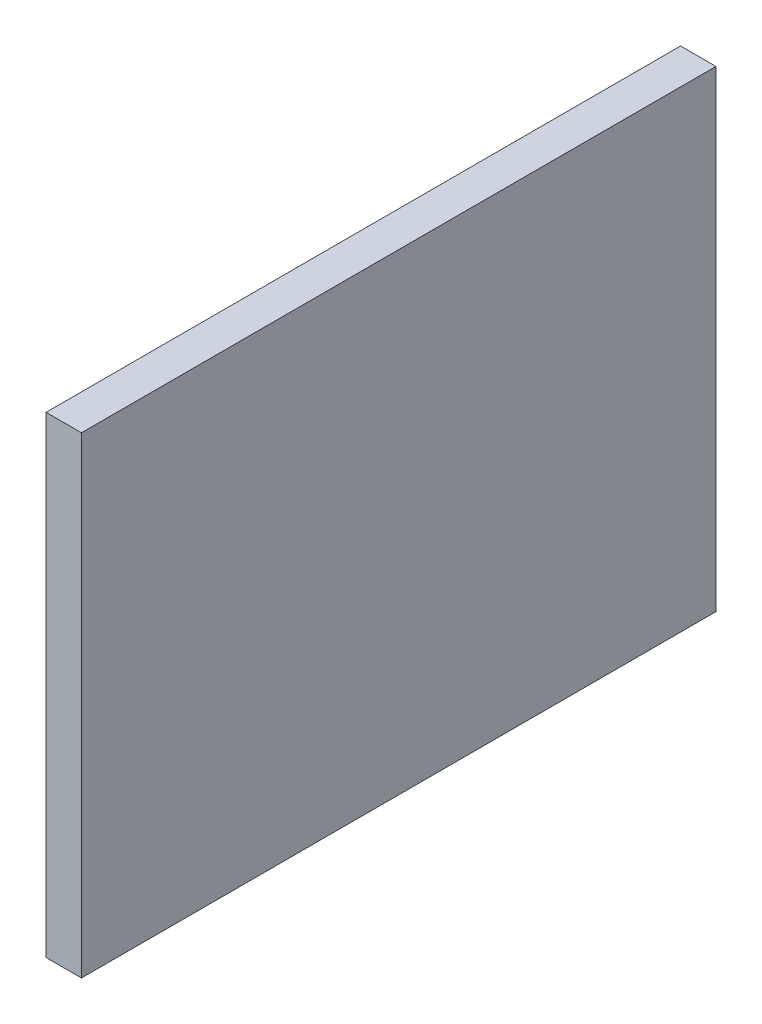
ISO-10303-21;
HEADER;
FILE_DESCRIPTION(('STEP AP214'),'2;1');
FILE_NAME('part.step','',(''),(''),'','','');
FILE_SCHEMA(('AUTOMOTIVE_DESIGN { 1 0 10303 214 1 1 1 1 }'));
ENDSEC;
DATA;
#1=APPLICATION_CONTEXT('core data for automotive mechanical design processes');
#2=APPLICATION_PROTOCOL_DEFINITION('international standard','automotive_design',2000,#1);
#3=PRODUCT_CONTEXT('',#1,'mechanical');
#4=PRODUCT('Part','Part','',(#3));
#5=PRODUCT_RELATED_PRODUCT_CATEGORY('part','',(#4));
#6=PRODUCT_DEFINITION_FORMATION('','',#4);
#7=PRODUCT_DEFINITION_CONTEXT('part definition',#1,'design');
#8=PRODUCT_DEFINITION('design','',#6,#7);
#9=PRODUCT_DEFINITION_SHAPE('','',#8);
#10=(LENGTH_UNIT() NAMED_UNIT(*) SI_UNIT(.MILLI.,.METRE.));
#11=(NAMED_UNIT(*) PLANE_ANGLE_UNIT() SI_UNIT($,.RADIAN.));
#12=(NAMED_UNIT(*) SI_UNIT($,.STERADIAN.) SOLID_ANGLE_UNIT());
#13=UNCERTAINTY_MEASURE_WITH_UNIT(LENGTH_MEASURE(1.E-05),#10,'distance_accuracy_value','');
#14=(GEOMETRIC_REPRESENTATION_CONTEXT(3) GLOBAL_UNCERTAINTY_ASSIGNED_CONTEXT((#13)) GLOBAL_UNIT_ASSIGNED_CONTEXT((#10,
#11,#12)) REPRESENTATION_CONTEXT('',''));
#15=CARTESIAN_POINT('',(0.,0.,0.));
#16=DIRECTION('',(0.,0.,1.));
#17=DIRECTION('',(1.,0.,0.));
#18=AXIS2_PLACEMENT_3D('',#15,#16,#17);
#19=CARTESIAN_POINT('',(0.,0.,215.));
#20=DIRECTION('',(1.,0.,0.));
#21=DIRECTION('',(0.,0.,-1.));
#22=AXIS2_PLACEMENT_3D('',#19,#20,#21);
#23=PLANE('',#22);
#24=DIRECTION('',(0.,-1.,0.));
#25=VECTOR('',#24,1.);
#26=CARTESIAN_POINT('',(0.,0.,0.));
#27=LINE('',#26,#25);
#28=CARTESIAN_POINT('',(0.,160.,0.));
#29=VERTEX_POINT('',#28);
#30=CARTESIAN_POINT('',(0.,0.,0.));
#31=VERTEX_POINT('',#30);
#32=EDGE_CURVE('E74',#29,#31,#27,.T.);
#33=ORIENTED_EDGE('',*,*,#32,.T.);
#34=DIRECTION('',(0.,0.,-1.));
#35=VECTOR('',#34,1.);
#36=CARTESIAN_POINT('',(0.,0.,215.));
#37=LINE('',#36,#35);
#38=CARTESIAN_POINT('',(0.,0.,215.));
#39=VERTEX_POINT('',#38);
#40=EDGE_CURVE('E11',#39,#31,#37,.T.);
#41=ORIENTED_EDGE('',*,*,#40,.F.);
#42=DIRECTION('',(0.,-1.,0.));
#43=VECTOR('',#42,1.);
#44=CARTESIAN_POINT('',(0.,0.,215.));
#45=LINE('',#44,#43);
#46=CARTESIAN_POINT('',(0.,160.,215.));
#47=VERTEX_POINT('',#46);
#48=EDGE_CURVE('E92',#47,#39,#45,.T.);
#49=ORIENTED_EDGE('',*,*,#48,.F.);
#50=DIRECTION('',(0.,0.,-1.));
#51=VECTOR('',#50,1.);
#52=CARTESIAN_POINT('',(0.,160.,215.));
#53=LINE('',#52,#51);
#54=EDGE_CURVE('E86',#47,#29,#53,.T.);
#55=ORIENTED_EDGE('',*,*,#54,.T.);
#56=EDGE_LOOP('',(#33,#41,#49,#55));
#57=FACE_BOUND('',#56,.T.);
#58=ADVANCED_FACE('F30',(#57),#23,.F.);
#59=CARTESIAN_POINT('',(0.,0.,215.));
#60=DIRECTION('',(0.,1.,0.));
#61=DIRECTION('',(0.,0.,1.));
#62=AXIS2_PLACEMENT_3D('',#59,#60,#61);
#63=PLANE('',#62);
#64=DIRECTION('',(1.,0.,0.));
#65=VECTOR('',#64,1.);
#66=CARTESIAN_POINT('',(0.,0.,0.));
#67=LINE('',#66,#65);
#68=CARTESIAN_POINT('',(12.,0.,0.));
#69=VERTEX_POINT('',#68);
#70=EDGE_CURVE('E70',#31,#69,#67,.T.);
#71=ORIENTED_EDGE('',*,*,#70,.T.);
#72=DIRECTION('',(0.,0.,-1.));
#73=VECTOR('',#72,1.);
#74=CARTESIAN_POINT('',(12.,0.,215.));
#75=LINE('',#74,#73);
#76=CARTESIAN_POINT('',(12.,0.,215.));
#77=VERTEX_POINT('',#76);
#78=EDGE_CURVE('E37',#77,#69,#75,.T.);
#79=ORIENTED_EDGE('',*,*,#78,.F.);
#80=DIRECTION('',(1.,0.,0.));
#81=VECTOR('',#80,1.);
#82=CARTESIAN_POINT('',(0.,0.,215.));
#83=LINE('',#82,#81);
#84=EDGE_CURVE('E82',#39,#77,#83,.T.);
#85=ORIENTED_EDGE('',*,*,#84,.F.);
#86=ORIENTED_EDGE('',*,*,#40,.T.);
#87=EDGE_LOOP('',(#71,#79,#85,#86));
#88=FACE_BOUND('',#87,.T.);
#89=ADVANCED_FACE('F81',(#88),#63,.F.);
#90=CARTESIAN_POINT('',(12.,0.,215.));
#91=DIRECTION('',(-1.,0.,0.));
#92=DIRECTION('',(0.,0.,1.));
#93=AXIS2_PLACEMENT_3D('',#90,#91,#92);
#94=PLANE('',#93);
#95=DIRECTION('',(0.,1.,0.));
#96=VECTOR('',#95,1.);
#97=CARTESIAN_POINT('',(12.,0.,0.));
#98=LINE('',#97,#96);
#99=CARTESIAN_POINT('',(12.,160.,0.));
#100=VERTEX_POINT('',#99);
#101=EDGE_CURVE('E75',#69,#100,#98,.T.);
#102=ORIENTED_EDGE('',*,*,#101,.T.);
#103=DIRECTION('',(0.,0.,-1.));
#104=VECTOR('',#103,1.);
#105=CARTESIAN_POINT('',(12.,160.,215.));
#106=LINE('',#105,#104);
#107=CARTESIAN_POINT('',(12.,160.,215.));
#108=VERTEX_POINT('',#107);
#109=EDGE_CURVE('E98',#108,#100,#106,.T.);
#110=ORIENTED_EDGE('',*,*,#109,.F.);
#111=DIRECTION('',(0.,1.,0.));
#112=VECTOR('',#111,1.);
#113=CARTESIAN_POINT('',(12.,0.,215.));
#114=LINE('',#113,#112);
#115=EDGE_CURVE('E49',#77,#108,#114,.T.);
#116=ORIENTED_EDGE('',*,*,#115,.F.);
#117=ORIENTED_EDGE('',*,*,#78,.T.);
#118=EDGE_LOOP('',(#102,#110,#116,#117));
#119=FACE_BOUND('',#118,.T.);
#120=ADVANCED_FACE('F101',(#119),#94,.F.);
#121=CARTESIAN_POINT('',(0.,160.,215.));
#122=DIRECTION('',(0.,-1.,0.));
#123=DIRECTION('',(0.,0.,-1.));
#124=AXIS2_PLACEMENT_3D('',#121,#122,#123);
#125=PLANE('',#124);
#126=DIRECTION('',(-1.,0.,0.));
#127=VECTOR('',#126,1.);
#128=CARTESIAN_POINT('',(0.,160.,0.));
#129=LINE('',#128,#127);
#130=EDGE_CURVE('E90',#100,#29,#129,.T.);
#131=ORIENTED_EDGE('',*,*,#130,.T.);
#132=ORIENTED_EDGE('',*,*,#54,.F.);
#133=DIRECTION('',(-1.,0.,0.));
#134=VECTOR('',#133,1.);
#135=CARTESIAN_POINT('',(0.,160.,215.));
#136=LINE('',#135,#134);
#137=EDGE_CURVE('E44',#108,#47,#136,.T.);
#138=ORIENTED_EDGE('',*,*,#137,.F.);
#139=ORIENTED_EDGE('',*,*,#109,.T.);
#140=EDGE_LOOP('',(#131,#132,#138,#139));
#141=FACE_BOUND('',#140,.T.);
#142=ADVANCED_FACE('F103',(#141),#125,.F.);
#143=CARTESIAN_POINT('',(0.,160.,215.));
#144=DIRECTION('',(0.,0.,-1.));
#145=DIRECTION('',(-1.,0.,0.));
#146=AXIS2_PLACEMENT_3D('',#143,#144,#145);
#147=PLANE('',#146);
#148=ORIENTED_EDGE('',*,*,#48,.T.);
#149=ORIENTED_EDGE('',*,*,#84,.T.);
#150=ORIENTED_EDGE('',*,*,#115,.T.);
#151=ORIENTED_EDGE('',*,*,#137,.T.);
#152=EDGE_LOOP('',(#148,#149,#150,#151));
#153=FACE_BOUND('',#152,.T.);
#154=ADVANCED_FACE('F104',(#153),#147,.F.);
#155=CARTESIAN_POINT('',(0.,160.,0.));
#156=DIRECTION('',(0.,0.,-1.));
#157=DIRECTION('',(-1.,0.,0.));
#158=AXIS2_PLACEMENT_3D('',#155,#156,#157);
#159=PLANE('',#158);
#160=ORIENTED_EDGE('',*,*,#32,.F.);
#161=ORIENTED_EDGE('',*,*,#130,.F.);
#162=ORIENTED_EDGE('',*,*,#101,.F.);
#163=ORIENTED_EDGE('',*,*,#70,.F.);
#164=EDGE_LOOP('',(#160,#161,#162,#163));
#165=FACE_BOUND('',#164,.T.);
#166=ADVANCED_FACE('F71',(#165),#159,.T.);
#167=CLOSED_SHELL('',(#58,#89,#120,#142,#154,#166));
#168=MANIFOLD_SOLID_BREP('B2',#167);
#169=ADVANCED_BREP_SHAPE_REPRESENTATION('',(#18,#168),#14);
#170=SHAPE_DEFINITION_REPRESENTATION(#9,#169);
ENDSEC;
END-ISO-10303-21;
